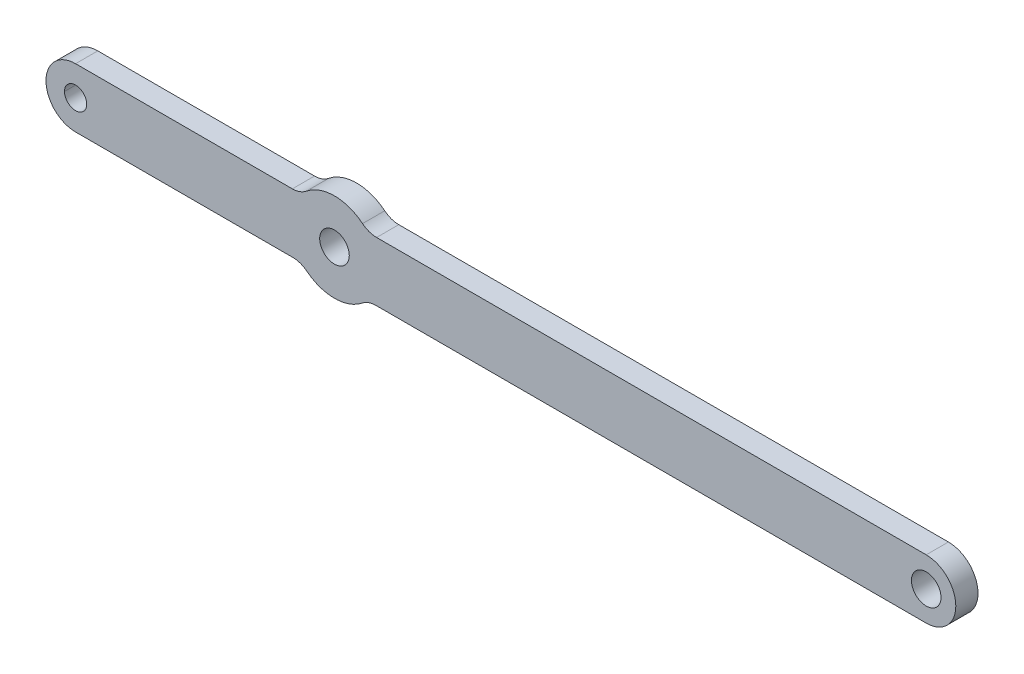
ISO-10303-21;
HEADER;
FILE_DESCRIPTION(('STEP AP214'),'2;1');
FILE_NAME('part.step','',(''),(''),'','','');
FILE_SCHEMA(('AUTOMOTIVE_DESIGN { 1 0 10303 214 1 1 1 1 }'));
ENDSEC;
DATA;
#1=APPLICATION_CONTEXT('core data for automotive mechanical design processes');
#2=APPLICATION_PROTOCOL_DEFINITION('international standard','automotive_design',2000,#1);
#3=PRODUCT_CONTEXT('',#1,'mechanical');
#4=PRODUCT('Part','Part','',(#3));
#5=PRODUCT_RELATED_PRODUCT_CATEGORY('part','',(#4));
#6=PRODUCT_DEFINITION_FORMATION('','',#4);
#7=PRODUCT_DEFINITION_CONTEXT('part definition',#1,'design');
#8=PRODUCT_DEFINITION('design','',#6,#7);
#9=PRODUCT_DEFINITION_SHAPE('','',#8);
#10=(LENGTH_UNIT() NAMED_UNIT(*) SI_UNIT(.MILLI.,.METRE.));
#11=(NAMED_UNIT(*) PLANE_ANGLE_UNIT() SI_UNIT($,.RADIAN.));
#12=(NAMED_UNIT(*) SI_UNIT($,.STERADIAN.) SOLID_ANGLE_UNIT());
#13=UNCERTAINTY_MEASURE_WITH_UNIT(LENGTH_MEASURE(1.E-05),#10,'distance_accuracy_value','');
#14=(GEOMETRIC_REPRESENTATION_CONTEXT(3) GLOBAL_UNCERTAINTY_ASSIGNED_CONTEXT((#13)) GLOBAL_UNIT_ASSIGNED_CONTEXT((#10,
#11,#12)) REPRESENTATION_CONTEXT('',''));
#15=CARTESIAN_POINT('',(0.,0.,0.));
#16=DIRECTION('',(0.,0.,1.));
#17=DIRECTION('',(1.,0.,0.));
#18=AXIS2_PLACEMENT_3D('',#15,#16,#17);
#19=CARTESIAN_POINT('',(101.910180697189,73.7175253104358,0.));
#20=DIRECTION('',(0.,0.,1.));
#21=DIRECTION('',(1.,0.,0.));
#22=AXIS2_PLACEMENT_3D('',#19,#20,#21);
#23=PLANE('',#22);
#24=CARTESIAN_POINT('',(216.910180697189,73.7175253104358,0.));
#25=DIRECTION('',(0.,0.,1.));
#26=DIRECTION('',(1.,0.,0.));
#27=AXIS2_PLACEMENT_3D('',#24,#25,#26);
#28=CIRCLE('',#27,2.);
#29=CARTESIAN_POINT('',(218.910180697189,73.7175253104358,0.));
#30=VERTEX_POINT('',#29);
#31=EDGE_CURVE('E343',#30,#30,#28,.T.);
#32=ORIENTED_EDGE('',*,*,#31,.T.);
#33=EDGE_LOOP('',(#32));
#34=FACE_BOUND('',#33,.T.);
#35=CARTESIAN_POINT('',(136.910180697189,73.7471789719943,0.));
#36=DIRECTION('',(0.,0.,1.));
#37=DIRECTION('',(1.,0.,0.));
#38=AXIS2_PLACEMENT_3D('',#35,#36,#37);
#39=CIRCLE('',#38,2.);
#40=CARTESIAN_POINT('',(138.910180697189,73.7471789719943,0.));
#41=VERTEX_POINT('',#40);
#42=EDGE_CURVE('E145',#41,#41,#39,.T.);
#43=ORIENTED_EDGE('',*,*,#42,.T.);
#44=EDGE_LOOP('',(#43));
#45=FACE_BOUND('',#44,.T.);
#46=CARTESIAN_POINT('',(101.910180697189,73.7175253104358,0.));
#47=DIRECTION('',(0.,0.,-1.));
#48=DIRECTION('',(-1.,0.,0.));
#49=AXIS2_PLACEMENT_3D('',#46,#47,#48);
#50=CIRCLE('',#49,1.5);
#51=CARTESIAN_POINT('',(103.410180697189,73.7175253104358,0.));
#52=VERTEX_POINT('',#51);
#53=CARTESIAN_POINT('',(100.410180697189,73.7175253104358,0.));
#54=VERTEX_POINT('',#53);
#55=EDGE_CURVE('E159',#52,#54,#50,.F.);
#56=ORIENTED_EDGE('',*,*,#55,.T.);
#57=CARTESIAN_POINT('',(101.910180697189,73.7175253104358,0.));
#58=DIRECTION('',(0.,0.,-1.));
#59=DIRECTION('',(-1.,0.,0.));
#60=AXIS2_PLACEMENT_3D('',#57,#58,#59);
#61=CIRCLE('',#60,1.5);
#62=EDGE_CURVE('E157',#54,#52,#61,.F.);
#63=ORIENTED_EDGE('',*,*,#62,.T.);
#64=EDGE_LOOP('',(#56,#63));
#65=FACE_BOUND('',#64,.T.);
#66=DIRECTION('',(1.,0.,0.));
#67=VECTOR('',#66,1.);
#68=CARTESIAN_POINT('',(101.910180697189,77.7175253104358,0.));
#69=LINE('',#68,#67);
#70=CARTESIAN_POINT('',(101.910180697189,77.7175253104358,0.));
#71=VERTEX_POINT('',#70);
#72=CARTESIAN_POINT('',(131.216827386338,77.7175253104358,0.));
#73=VERTEX_POINT('',#72);
#74=EDGE_CURVE('E138',#71,#73,#69,.T.);
#75=ORIENTED_EDGE('',*,*,#74,.T.);
#76=CARTESIAN_POINT('',(131.216827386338,80.7175253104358,0.));
#77=DIRECTION('',(0.,0.,-1.));
#78=DIRECTION('',(-1.,0.,0.));
#79=AXIS2_PLACEMENT_3D('',#76,#77,#78);
#80=CIRCLE('',#79,3.);
#81=CARTESIAN_POINT('',(133.114611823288,78.3940765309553,0.));
#82=VERTEX_POINT('',#81);
#83=EDGE_CURVE('E211',#73,#82,#80,.F.);
#84=ORIENTED_EDGE('',*,*,#83,.T.);
#85=CARTESIAN_POINT('',(136.910180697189,73.7471789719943,0.));
#86=DIRECTION('',(0.,0.,-1.));
#87=DIRECTION('',(-1.,0.,0.));
#88=AXIS2_PLACEMENT_3D('',#85,#86,#87);
#89=CIRCLE('',#88,6.00000000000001);
#90=CARTESIAN_POINT('',(140.705749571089,78.3940765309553,0.));
#91=VERTEX_POINT('',#90);
#92=EDGE_CURVE('E214',#91,#82,#89,.F.);
#93=ORIENTED_EDGE('',*,*,#92,.F.);
#94=CARTESIAN_POINT('',(142.60353400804,80.7175253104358,0.));
#95=DIRECTION('',(0.,0.,-1.));
#96=DIRECTION('',(-1.,0.,0.));
#97=AXIS2_PLACEMENT_3D('',#94,#95,#96);
#98=CIRCLE('',#97,3.);
#99=CARTESIAN_POINT('',(142.60353400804,77.7175253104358,0.));
#100=VERTEX_POINT('',#99);
#101=EDGE_CURVE('E217',#91,#100,#98,.F.);
#102=ORIENTED_EDGE('',*,*,#101,.T.);
#103=DIRECTION('',(1.,0.,0.));
#104=VECTOR('',#103,1.);
#105=CARTESIAN_POINT('',(142.60353400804,77.7175253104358,0.));
#106=LINE('',#105,#104);
#107=CARTESIAN_POINT('',(216.910180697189,77.7175253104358,0.));
#108=VERTEX_POINT('',#107);
#109=EDGE_CURVE('E164',#100,#108,#106,.T.);
#110=ORIENTED_EDGE('',*,*,#109,.T.);
#111=CARTESIAN_POINT('',(216.910180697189,73.7175253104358,0.));
#112=DIRECTION('',(0.,0.,-1.));
#113=DIRECTION('',(-1.,0.,0.));
#114=AXIS2_PLACEMENT_3D('',#111,#112,#113);
#115=CIRCLE('',#114,4.);
#116=CARTESIAN_POINT('',(216.910180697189,69.7175253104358,0.));
#117=VERTEX_POINT('',#116);
#118=EDGE_CURVE('E172',#117,#108,#115,.F.);
#119=ORIENTED_EDGE('',*,*,#118,.F.);
#120=DIRECTION('',(1.,0.,0.));
#121=VECTOR('',#120,1.);
#122=CARTESIAN_POINT('',(142.530142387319,69.7175253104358,0.));
#123=LINE('',#122,#121);
#124=CARTESIAN_POINT('',(142.530142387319,69.7175253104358,0.));
#125=VERTEX_POINT('',#124);
#126=EDGE_CURVE('E169',#117,#125,#123,.F.);
#127=ORIENTED_EDGE('',*,*,#126,.T.);
#128=CARTESIAN_POINT('',(142.530142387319,66.7175253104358,0.));
#129=DIRECTION('',(0.,0.,-1.));
#130=DIRECTION('',(-1.,0.,0.));
#131=AXIS2_PLACEMENT_3D('',#128,#129,#130);
#132=CIRCLE('',#131,3.);
#133=CARTESIAN_POINT('',(140.656821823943,69.060743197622,0.));
#134=VERTEX_POINT('',#133);
#135=EDGE_CURVE('E222',#125,#134,#132,.F.);
#136=ORIENTED_EDGE('',*,*,#135,.T.);
#137=CARTESIAN_POINT('',(136.910180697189,73.7471789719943,0.));
#138=DIRECTION('',(0.,0.,-1.));
#139=DIRECTION('',(-1.,0.,0.));
#140=AXIS2_PLACEMENT_3D('',#137,#138,#139);
#141=CIRCLE('',#140,6.00000000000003);
#142=CARTESIAN_POINT('',(133.163539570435,69.060743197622,0.));
#143=VERTEX_POINT('',#142);
#144=EDGE_CURVE('E226',#143,#134,#141,.F.);
#145=ORIENTED_EDGE('',*,*,#144,.F.);
#146=CARTESIAN_POINT('',(131.290219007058,66.7175253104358,0.));
#147=DIRECTION('',(0.,0.,-1.));
#148=DIRECTION('',(-1.,0.,0.));
#149=AXIS2_PLACEMENT_3D('',#146,#147,#148);
#150=CIRCLE('',#149,3.);
#151=CARTESIAN_POINT('',(131.290219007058,69.7175253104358,0.));
#152=VERTEX_POINT('',#151);
#153=EDGE_CURVE('E229',#143,#152,#150,.F.);
#154=ORIENTED_EDGE('',*,*,#153,.T.);
#155=DIRECTION('',(1.,0.,0.));
#156=VECTOR('',#155,1.);
#157=CARTESIAN_POINT('',(101.910180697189,69.7175253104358,0.));
#158=LINE('',#157,#156);
#159=CARTESIAN_POINT('',(101.910180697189,69.7175253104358,0.));
#160=VERTEX_POINT('',#159);
#161=EDGE_CURVE('E174',#152,#160,#158,.F.);
#162=ORIENTED_EDGE('',*,*,#161,.T.);
#163=CARTESIAN_POINT('',(101.910180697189,73.7175253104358,0.));
#164=DIRECTION('',(0.,0.,-1.));
#165=DIRECTION('',(-1.,0.,0.));
#166=AXIS2_PLACEMENT_3D('',#163,#164,#165);
#167=CIRCLE('',#166,4.);
#168=CARTESIAN_POINT('',(97.9101806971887,73.7175253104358,0.));
#169=VERTEX_POINT('',#168);
#170=EDGE_CURVE('E141',#169,#160,#167,.F.);
#171=ORIENTED_EDGE('',*,*,#170,.F.);
#172=CARTESIAN_POINT('',(101.910180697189,73.7175253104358,0.));
#173=DIRECTION('',(0.,0.,-1.));
#174=DIRECTION('',(-1.,0.,0.));
#175=AXIS2_PLACEMENT_3D('',#172,#173,#174);
#176=CIRCLE('',#175,4.);
#177=EDGE_CURVE('E33',#71,#169,#176,.F.);
#178=ORIENTED_EDGE('',*,*,#177,.F.);
#179=EDGE_LOOP('',(#75,#84,#93,#102,#110,#119,#127,#136,#145,#154,#162,#171,#178));
#180=FACE_BOUND('',#179,.T.);
#181=ADVANCED_FACE('F30',(#34,#45,#65,#180),#23,.F.);
#182=CARTESIAN_POINT('',(101.910180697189,73.7175253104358,3.));
#183=DIRECTION('',(0.,0.,-1.));
#184=DIRECTION('',(-1.,0.,0.));
#185=AXIS2_PLACEMENT_3D('',#182,#183,#184);
#186=CYLINDRICAL_SURFACE('',#185,4.);
#187=DIRECTION('',(0.,0.,-1.));
#188=VECTOR('',#187,1.);
#189=CARTESIAN_POINT('',(101.910180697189,77.7175253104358,3.));
#190=LINE('',#189,#188);
#191=CARTESIAN_POINT('',(101.910180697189,77.7175253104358,3.));
#192=VERTEX_POINT('',#191);
#193=EDGE_CURVE('E147',#192,#71,#190,.T.);
#194=ORIENTED_EDGE('',*,*,#193,.T.);
#195=ORIENTED_EDGE('',*,*,#177,.T.);
#196=DIRECTION('',(0.,0.,-1.));
#197=VECTOR('',#196,1.);
#198=CARTESIAN_POINT('',(97.9101806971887,73.7175253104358,3.));
#199=LINE('',#198,#197);
#200=CARTESIAN_POINT('',(97.9101806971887,73.7175253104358,3.));
#201=VERTEX_POINT('',#200);
#202=EDGE_CURVE('E144',#201,#169,#199,.T.);
#203=ORIENTED_EDGE('',*,*,#202,.F.);
#204=CARTESIAN_POINT('',(101.910180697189,73.7175253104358,3.));
#205=DIRECTION('',(0.,0.,-1.));
#206=DIRECTION('',(-1.,0.,0.));
#207=AXIS2_PLACEMENT_3D('',#204,#205,#206);
#208=CIRCLE('',#207,4.);
#209=EDGE_CURVE('E150',#192,#201,#208,.F.);
#210=ORIENTED_EDGE('',*,*,#209,.F.);
#211=EDGE_LOOP('',(#194,#195,#203,#210));
#212=FACE_BOUND('',#211,.T.);
#213=ADVANCED_FACE('F148',(#212),#186,.T.);
#214=CARTESIAN_POINT('',(101.910180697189,73.7175253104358,3.));
#215=DIRECTION('',(0.,0.,-1.));
#216=DIRECTION('',(-1.,0.,0.));
#217=AXIS2_PLACEMENT_3D('',#214,#215,#216);
#218=CYLINDRICAL_SURFACE('',#217,4.);
#219=ORIENTED_EDGE('',*,*,#170,.T.);
#220=DIRECTION('',(0.,0.,1.));
#221=VECTOR('',#220,1.);
#222=CARTESIAN_POINT('',(101.910180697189,69.7175253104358,3.));
#223=LINE('',#222,#221);
#224=CARTESIAN_POINT('',(101.910180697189,69.7175253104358,3.));
#225=VERTEX_POINT('',#224);
#226=EDGE_CURVE('E176',#160,#225,#223,.T.);
#227=ORIENTED_EDGE('',*,*,#226,.T.);
#228=CARTESIAN_POINT('',(101.910180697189,73.7175253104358,3.));
#229=DIRECTION('',(0.,0.,-1.));
#230=DIRECTION('',(-1.,0.,0.));
#231=AXIS2_PLACEMENT_3D('',#228,#229,#230);
#232=CIRCLE('',#231,4.);
#233=EDGE_CURVE('E205',#201,#225,#232,.F.);
#234=ORIENTED_EDGE('',*,*,#233,.F.);
#235=ORIENTED_EDGE('',*,*,#202,.T.);
#236=EDGE_LOOP('',(#219,#227,#234,#235));
#237=FACE_BOUND('',#236,.T.);
#238=ADVANCED_FACE('F233',(#237),#218,.T.);
#239=CARTESIAN_POINT('',(101.910180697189,69.7175253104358,3.));
#240=DIRECTION('',(0.,1.,0.));
#241=DIRECTION('',(0.,0.,1.));
#242=AXIS2_PLACEMENT_3D('',#239,#240,#241);
#243=PLANE('',#242);
#244=DIRECTION('',(0.,0.,-1.));
#245=VECTOR('',#244,1.);
#246=CARTESIAN_POINT('',(131.290219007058,69.7175253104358,3.));
#247=LINE('',#246,#245);
#248=CARTESIAN_POINT('',(131.290219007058,69.7175253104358,3.));
#249=VERTEX_POINT('',#248);
#250=EDGE_CURVE('E175',#152,#249,#247,.F.);
#251=ORIENTED_EDGE('',*,*,#250,.T.);
#252=DIRECTION('',(1.,0.,0.));
#253=VECTOR('',#252,1.);
#254=CARTESIAN_POINT('',(101.910180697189,69.7175253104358,3.));
#255=LINE('',#254,#253);
#256=EDGE_CURVE('E204',#225,#249,#255,.T.);
#257=ORIENTED_EDGE('',*,*,#256,.F.);
#258=ORIENTED_EDGE('',*,*,#226,.F.);
#259=ORIENTED_EDGE('',*,*,#161,.F.);
#260=EDGE_LOOP('',(#251,#257,#258,#259));
#261=FACE_BOUND('',#260,.T.);
#262=ADVANCED_FACE('F268',(#261),#243,.F.);
#263=CARTESIAN_POINT('',(131.290219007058,66.7175253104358,3.));
#264=DIRECTION('',(0.,0.,-1.));
#265=DIRECTION('',(-1.,0.,0.));
#266=AXIS2_PLACEMENT_3D('',#263,#264,#265);
#267=CYLINDRICAL_SURFACE('',#266,3.);
#268=DIRECTION('',(0.,0.,-1.));
#269=VECTOR('',#268,1.);
#270=CARTESIAN_POINT('',(133.163539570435,69.060743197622,3.));
#271=LINE('',#270,#269);
#272=CARTESIAN_POINT('',(133.163539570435,69.060743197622,3.));
#273=VERTEX_POINT('',#272);
#274=EDGE_CURVE('E228',#273,#143,#271,.T.);
#275=ORIENTED_EDGE('',*,*,#274,.F.);
#276=CARTESIAN_POINT('',(131.290219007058,66.7175253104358,3.));
#277=DIRECTION('',(0.,0.,-1.));
#278=DIRECTION('',(-1.,0.,0.));
#279=AXIS2_PLACEMENT_3D('',#276,#277,#278);
#280=CIRCLE('',#279,3.);
#281=EDGE_CURVE('E201',#249,#273,#280,.T.);
#282=ORIENTED_EDGE('',*,*,#281,.F.);
#283=ORIENTED_EDGE('',*,*,#250,.F.);
#284=ORIENTED_EDGE('',*,*,#153,.F.);
#285=EDGE_LOOP('',(#275,#282,#283,#284));
#286=FACE_BOUND('',#285,.T.);
#287=ADVANCED_FACE('F271',(#286),#267,.F.);
#288=CARTESIAN_POINT('',(136.910180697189,73.7471789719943,3.));
#289=DIRECTION('',(0.,0.,-1.));
#290=DIRECTION('',(-1.,0.,0.));
#291=AXIS2_PLACEMENT_3D('',#288,#289,#290);
#292=CYLINDRICAL_SURFACE('',#291,6.00000000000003);
#293=CARTESIAN_POINT('',(136.910180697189,73.7471789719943,3.));
#294=DIRECTION('',(0.,0.,-1.));
#295=DIRECTION('',(-1.,0.,0.));
#296=AXIS2_PLACEMENT_3D('',#293,#294,#295);
#297=CIRCLE('',#296,6.00000000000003);
#298=CARTESIAN_POINT('',(140.656821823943,69.060743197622,3.));
#299=VERTEX_POINT('',#298);
#300=EDGE_CURVE('E198',#273,#299,#297,.F.);
#301=ORIENTED_EDGE('',*,*,#300,.F.);
#302=ORIENTED_EDGE('',*,*,#274,.T.);
#303=ORIENTED_EDGE('',*,*,#144,.T.);
#304=DIRECTION('',(0.,0.,-1.));
#305=VECTOR('',#304,1.);
#306=CARTESIAN_POINT('',(140.656821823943,69.060743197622,3.));
#307=LINE('',#306,#305);
#308=EDGE_CURVE('E225',#134,#299,#307,.F.);
#309=ORIENTED_EDGE('',*,*,#308,.T.);
#310=EDGE_LOOP('',(#301,#302,#303,#309));
#311=FACE_BOUND('',#310,.T.);
#312=ADVANCED_FACE('F275',(#311),#292,.T.);
#313=CARTESIAN_POINT('',(142.530142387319,66.7175253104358,3.));
#314=DIRECTION('',(0.,0.,-1.));
#315=DIRECTION('',(-1.,0.,0.));
#316=AXIS2_PLACEMENT_3D('',#313,#314,#315);
#317=CYLINDRICAL_SURFACE('',#316,3.);
#318=DIRECTION('',(0.,0.,1.));
#319=VECTOR('',#318,1.);
#320=CARTESIAN_POINT('',(142.530142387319,69.7175253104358,3.));
#321=LINE('',#320,#319);
#322=CARTESIAN_POINT('',(142.530142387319,69.7175253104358,3.));
#323=VERTEX_POINT('',#322);
#324=EDGE_CURVE('E173',#125,#323,#321,.T.);
#325=ORIENTED_EDGE('',*,*,#324,.T.);
#326=CARTESIAN_POINT('',(142.530142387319,66.7175253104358,3.));
#327=DIRECTION('',(0.,0.,-1.));
#328=DIRECTION('',(-1.,0.,0.));
#329=AXIS2_PLACEMENT_3D('',#326,#327,#328);
#330=CIRCLE('',#329,3.);
#331=EDGE_CURVE('E195',#299,#323,#330,.T.);
#332=ORIENTED_EDGE('',*,*,#331,.F.);
#333=ORIENTED_EDGE('',*,*,#308,.F.);
#334=ORIENTED_EDGE('',*,*,#135,.F.);
#335=EDGE_LOOP('',(#325,#332,#333,#334));
#336=FACE_BOUND('',#335,.T.);
#337=ADVANCED_FACE('F278',(#336),#317,.F.);
#338=CARTESIAN_POINT('',(142.530142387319,69.7175253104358,3.));
#339=DIRECTION('',(0.,1.,0.));
#340=DIRECTION('',(0.,0.,1.));
#341=AXIS2_PLACEMENT_3D('',#338,#339,#340);
#342=PLANE('',#341);
#343=DIRECTION('',(0.,0.,-1.));
#344=VECTOR('',#343,1.);
#345=CARTESIAN_POINT('',(216.910180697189,69.7175253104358,3.));
#346=LINE('',#345,#344);
#347=CARTESIAN_POINT('',(216.910180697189,69.7175253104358,3.));
#348=VERTEX_POINT('',#347);
#349=EDGE_CURVE('E221',#348,#117,#346,.T.);
#350=ORIENTED_EDGE('',*,*,#349,.F.);
#351=DIRECTION('',(1.,0.,0.));
#352=VECTOR('',#351,1.);
#353=CARTESIAN_POINT('',(101.910180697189,69.7175253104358,3.));
#354=LINE('',#353,#352);
#355=EDGE_CURVE('E194',#323,#348,#354,.T.);
#356=ORIENTED_EDGE('',*,*,#355,.F.);
#357=ORIENTED_EDGE('',*,*,#324,.F.);
#358=ORIENTED_EDGE('',*,*,#126,.F.);
#359=EDGE_LOOP('',(#350,#356,#357,#358));
#360=FACE_BOUND('',#359,.T.);
#361=ADVANCED_FACE('F283',(#360),#342,.F.);
#362=CARTESIAN_POINT('',(216.910180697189,73.7175253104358,3.));
#363=DIRECTION('',(0.,0.,-1.));
#364=DIRECTION('',(-1.,0.,0.));
#365=AXIS2_PLACEMENT_3D('',#362,#363,#364);
#366=CYLINDRICAL_SURFACE('',#365,4.);
#367=CARTESIAN_POINT('',(216.910180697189,73.7175253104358,3.));
#368=DIRECTION('',(0.,0.,-1.));
#369=DIRECTION('',(-1.,0.,0.));
#370=AXIS2_PLACEMENT_3D('',#367,#368,#369);
#371=CIRCLE('',#370,4.);
#372=CARTESIAN_POINT('',(216.910180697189,77.7175253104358,3.));
#373=VERTEX_POINT('',#372);
#374=EDGE_CURVE('E191',#348,#373,#371,.F.);
#375=ORIENTED_EDGE('',*,*,#374,.F.);
#376=ORIENTED_EDGE('',*,*,#349,.T.);
#377=ORIENTED_EDGE('',*,*,#118,.T.);
#378=DIRECTION('',(0.,0.,-1.));
#379=VECTOR('',#378,1.);
#380=CARTESIAN_POINT('',(216.910180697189,77.7175253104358,3.));
#381=LINE('',#380,#379);
#382=EDGE_CURVE('E168',#108,#373,#381,.F.);
#383=ORIENTED_EDGE('',*,*,#382,.T.);
#384=EDGE_LOOP('',(#375,#376,#377,#383));
#385=FACE_BOUND('',#384,.T.);
#386=ADVANCED_FACE('F287',(#385),#366,.T.);
#387=CARTESIAN_POINT('',(142.60353400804,77.7175253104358,3.));
#388=DIRECTION('',(0.,-1.,0.));
#389=DIRECTION('',(0.,0.,-1.));
#390=AXIS2_PLACEMENT_3D('',#387,#388,#389);
#391=PLANE('',#390);
#392=DIRECTION('',(0.,0.,-1.));
#393=VECTOR('',#392,1.);
#394=CARTESIAN_POINT('',(142.60353400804,77.7175253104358,3.));
#395=LINE('',#394,#393);
#396=CARTESIAN_POINT('',(142.60353400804,77.7175253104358,3.));
#397=VERTEX_POINT('',#396);
#398=EDGE_CURVE('E167',#100,#397,#395,.F.);
#399=ORIENTED_EDGE('',*,*,#398,.T.);
#400=DIRECTION('',(1.,0.,0.));
#401=VECTOR('',#400,1.);
#402=CARTESIAN_POINT('',(101.910180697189,77.7175253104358,3.));
#403=LINE('',#402,#401);
#404=EDGE_CURVE('E190',#373,#397,#403,.F.);
#405=ORIENTED_EDGE('',*,*,#404,.F.);
#406=ORIENTED_EDGE('',*,*,#382,.F.);
#407=ORIENTED_EDGE('',*,*,#109,.F.);
#408=EDGE_LOOP('',(#399,#405,#406,#407));
#409=FACE_BOUND('',#408,.T.);
#410=ADVANCED_FACE('F290',(#409),#391,.F.);
#411=CARTESIAN_POINT('',(142.60353400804,80.7175253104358,3.));
#412=DIRECTION('',(0.,0.,-1.));
#413=DIRECTION('',(-1.,0.,0.));
#414=AXIS2_PLACEMENT_3D('',#411,#412,#413);
#415=CYLINDRICAL_SURFACE('',#414,3.);
#416=DIRECTION('',(0.,0.,-1.));
#417=VECTOR('',#416,1.);
#418=CARTESIAN_POINT('',(140.705749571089,78.3940765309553,3.));
#419=LINE('',#418,#417);
#420=CARTESIAN_POINT('',(140.705749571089,78.3940765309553,3.));
#421=VERTEX_POINT('',#420);
#422=EDGE_CURVE('E216',#421,#91,#419,.T.);
#423=ORIENTED_EDGE('',*,*,#422,.F.);
#424=CARTESIAN_POINT('',(142.60353400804,80.7175253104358,3.));
#425=DIRECTION('',(0.,0.,-1.));
#426=DIRECTION('',(-1.,0.,0.));
#427=AXIS2_PLACEMENT_3D('',#424,#425,#426);
#428=CIRCLE('',#427,3.);
#429=EDGE_CURVE('E187',#397,#421,#428,.T.);
#430=ORIENTED_EDGE('',*,*,#429,.F.);
#431=ORIENTED_EDGE('',*,*,#398,.F.);
#432=ORIENTED_EDGE('',*,*,#101,.F.);
#433=EDGE_LOOP('',(#423,#430,#431,#432));
#434=FACE_BOUND('',#433,.T.);
#435=ADVANCED_FACE('F295',(#434),#415,.F.);
#436=CARTESIAN_POINT('',(136.910180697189,73.7471789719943,3.));
#437=DIRECTION('',(0.,0.,-1.));
#438=DIRECTION('',(-1.,0.,0.));
#439=AXIS2_PLACEMENT_3D('',#436,#437,#438);
#440=CYLINDRICAL_SURFACE('',#439,6.00000000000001);
#441=CARTESIAN_POINT('',(136.910180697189,73.7471789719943,3.));
#442=DIRECTION('',(0.,0.,-1.));
#443=DIRECTION('',(-1.,0.,0.));
#444=AXIS2_PLACEMENT_3D('',#441,#442,#443);
#445=CIRCLE('',#444,6.00000000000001);
#446=CARTESIAN_POINT('',(133.114611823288,78.3940765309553,3.));
#447=VERTEX_POINT('',#446);
#448=EDGE_CURVE('E184',#421,#447,#445,.F.);
#449=ORIENTED_EDGE('',*,*,#448,.F.);
#450=ORIENTED_EDGE('',*,*,#422,.T.);
#451=ORIENTED_EDGE('',*,*,#92,.T.);
#452=DIRECTION('',(0.,0.,-1.));
#453=VECTOR('',#452,1.);
#454=CARTESIAN_POINT('',(133.114611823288,78.3940765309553,3.));
#455=LINE('',#454,#453);
#456=EDGE_CURVE('E213',#82,#447,#455,.F.);
#457=ORIENTED_EDGE('',*,*,#456,.T.);
#458=EDGE_LOOP('',(#449,#450,#451,#457));
#459=FACE_BOUND('',#458,.T.);
#460=ADVANCED_FACE('F298',(#459),#440,.T.);
#461=CARTESIAN_POINT('',(131.216827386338,80.7175253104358,3.));
#462=DIRECTION('',(0.,0.,-1.));
#463=DIRECTION('',(-1.,0.,0.));
#464=AXIS2_PLACEMENT_3D('',#461,#462,#463);
#465=CYLINDRICAL_SURFACE('',#464,3.);
#466=DIRECTION('',(0.,0.,-1.));
#467=VECTOR('',#466,1.);
#468=CARTESIAN_POINT('',(131.216827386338,77.7175253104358,3.));
#469=LINE('',#468,#467);
#470=CARTESIAN_POINT('',(131.216827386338,77.7175253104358,3.));
#471=VERTEX_POINT('',#470);
#472=EDGE_CURVE('E154',#73,#471,#469,.F.);
#473=ORIENTED_EDGE('',*,*,#472,.T.);
#474=CARTESIAN_POINT('',(131.216827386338,80.7175253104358,3.));
#475=DIRECTION('',(0.,0.,-1.));
#476=DIRECTION('',(-1.,0.,0.));
#477=AXIS2_PLACEMENT_3D('',#474,#475,#476);
#478=CIRCLE('',#477,3.);
#479=EDGE_CURVE('E181',#447,#471,#478,.T.);
#480=ORIENTED_EDGE('',*,*,#479,.F.);
#481=ORIENTED_EDGE('',*,*,#456,.F.);
#482=ORIENTED_EDGE('',*,*,#83,.F.);
#483=EDGE_LOOP('',(#473,#480,#481,#482));
#484=FACE_BOUND('',#483,.T.);
#485=ADVANCED_FACE('F301',(#484),#465,.F.);
#486=CARTESIAN_POINT('',(101.910180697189,77.7175253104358,3.));
#487=DIRECTION('',(0.,-1.,0.));
#488=DIRECTION('',(0.,0.,-1.));
#489=AXIS2_PLACEMENT_3D('',#486,#487,#488);
#490=PLANE('',#489);
#491=ORIENTED_EDGE('',*,*,#193,.F.);
#492=DIRECTION('',(1.,0.,0.));
#493=VECTOR('',#492,1.);
#494=CARTESIAN_POINT('',(101.910180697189,77.7175253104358,3.));
#495=LINE('',#494,#493);
#496=EDGE_CURVE('E180',#471,#192,#495,.F.);
#497=ORIENTED_EDGE('',*,*,#496,.F.);
#498=ORIENTED_EDGE('',*,*,#472,.F.);
#499=ORIENTED_EDGE('',*,*,#74,.F.);
#500=EDGE_LOOP('',(#491,#497,#498,#499));
#501=FACE_BOUND('',#500,.T.);
#502=ADVANCED_FACE('F156',(#501),#490,.F.);
#503=CARTESIAN_POINT('',(101.910180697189,73.7175253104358,3.));
#504=DIRECTION('',(0.,0.,-1.));
#505=DIRECTION('',(-1.,0.,0.));
#506=AXIS2_PLACEMENT_3D('',#503,#504,#505);
#507=CYLINDRICAL_SURFACE('',#506,1.5);
#508=DIRECTION('',(0.,0.,-1.));
#509=VECTOR('',#508,1.);
#510=CARTESIAN_POINT('',(103.410180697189,73.7175253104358,3.));
#511=LINE('',#510,#509);
#512=CARTESIAN_POINT('',(103.410180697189,73.7175253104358,3.));
#513=VERTEX_POINT('',#512);
#514=EDGE_CURVE('E209',#513,#52,#511,.T.);
#515=ORIENTED_EDGE('',*,*,#514,.T.);
#516=ORIENTED_EDGE('',*,*,#62,.F.);
#517=DIRECTION('',(0.,0.,-1.));
#518=VECTOR('',#517,1.);
#519=CARTESIAN_POINT('',(100.410180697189,73.7175253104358,3.));
#520=LINE('',#519,#518);
#521=CARTESIAN_POINT('',(100.410180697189,73.7175253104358,3.));
#522=VERTEX_POINT('',#521);
#523=EDGE_CURVE('E48',#54,#522,#520,.F.);
#524=ORIENTED_EDGE('',*,*,#523,.T.);
#525=CARTESIAN_POINT('',(101.910180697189,73.7175253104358,3.));
#526=DIRECTION('',(0.,0.,-1.));
#527=DIRECTION('',(-1.,0.,0.));
#528=AXIS2_PLACEMENT_3D('',#525,#526,#527);
#529=CIRCLE('',#528,1.5);
#530=EDGE_CURVE('E39',#513,#522,#529,.T.);
#531=ORIENTED_EDGE('',*,*,#530,.F.);
#532=EDGE_LOOP('',(#515,#516,#524,#531));
#533=FACE_BOUND('',#532,.T.);
#534=ADVANCED_FACE('F308',(#533),#507,.F.);
#535=CARTESIAN_POINT('',(101.910180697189,73.7175253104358,3.));
#536=DIRECTION('',(0.,0.,-1.));
#537=DIRECTION('',(-1.,0.,0.));
#538=AXIS2_PLACEMENT_3D('',#535,#536,#537);
#539=CYLINDRICAL_SURFACE('',#538,1.5);
#540=CARTESIAN_POINT('',(101.910180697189,73.7175253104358,3.));
#541=DIRECTION('',(0.,0.,-1.));
#542=DIRECTION('',(-1.,0.,0.));
#543=AXIS2_PLACEMENT_3D('',#540,#541,#542);
#544=CIRCLE('',#543,1.5);
#545=EDGE_CURVE('E11',#522,#513,#544,.T.);
#546=ORIENTED_EDGE('',*,*,#545,.F.);
#547=ORIENTED_EDGE('',*,*,#523,.F.);
#548=ORIENTED_EDGE('',*,*,#55,.F.);
#549=ORIENTED_EDGE('',*,*,#514,.F.);
#550=EDGE_LOOP('',(#546,#547,#548,#549));
#551=FACE_BOUND('',#550,.T.);
#552=ADVANCED_FACE('F313',(#551),#539,.F.);
#553=CARTESIAN_POINT('',(101.910180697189,73.7175253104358,3.));
#554=DIRECTION('',(0.,0.,1.));
#555=DIRECTION('',(1.,0.,0.));
#556=AXIS2_PLACEMENT_3D('',#553,#554,#555);
#557=PLANE('',#556);
#558=CARTESIAN_POINT('',(216.910180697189,73.7175253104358,3.));
#559=DIRECTION('',(0.,0.,1.));
#560=DIRECTION('',(1.,0.,0.));
#561=AXIS2_PLACEMENT_3D('',#558,#559,#560);
#562=CIRCLE('',#561,2.);
#563=CARTESIAN_POINT('',(218.910180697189,73.7175253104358,3.));
#564=VERTEX_POINT('',#563);
#565=EDGE_CURVE('E348',#564,#564,#562,.T.);
#566=ORIENTED_EDGE('',*,*,#565,.F.);
#567=EDGE_LOOP('',(#566));
#568=FACE_BOUND('',#567,.T.);
#569=CARTESIAN_POINT('',(136.910180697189,73.7471789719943,3.));
#570=DIRECTION('',(0.,0.,1.));
#571=DIRECTION('',(1.,0.,0.));
#572=AXIS2_PLACEMENT_3D('',#569,#570,#571);
#573=CIRCLE('',#572,2.);
#574=CARTESIAN_POINT('',(138.910180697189,73.7471789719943,3.));
#575=VERTEX_POINT('',#574);
#576=EDGE_CURVE('E243',#575,#575,#573,.T.);
#577=ORIENTED_EDGE('',*,*,#576,.F.);
#578=EDGE_LOOP('',(#577));
#579=FACE_BOUND('',#578,.T.);
#580=ORIENTED_EDGE('',*,*,#530,.T.);
#581=ORIENTED_EDGE('',*,*,#545,.T.);
#582=EDGE_LOOP('',(#580,#581));
#583=FACE_BOUND('',#582,.T.);
#584=ORIENTED_EDGE('',*,*,#479,.T.);
#585=ORIENTED_EDGE('',*,*,#496,.T.);
#586=ORIENTED_EDGE('',*,*,#209,.T.);
#587=ORIENTED_EDGE('',*,*,#233,.T.);
#588=ORIENTED_EDGE('',*,*,#256,.T.);
#589=ORIENTED_EDGE('',*,*,#281,.T.);
#590=ORIENTED_EDGE('',*,*,#300,.T.);
#591=ORIENTED_EDGE('',*,*,#331,.T.);
#592=ORIENTED_EDGE('',*,*,#355,.T.);
#593=ORIENTED_EDGE('',*,*,#374,.T.);
#594=ORIENTED_EDGE('',*,*,#404,.T.);
#595=ORIENTED_EDGE('',*,*,#429,.T.);
#596=ORIENTED_EDGE('',*,*,#448,.T.);
#597=EDGE_LOOP('',(#584,#585,#586,#587,#588,#589,#590,#591,#592,#593,#594,#595,#596));
#598=FACE_BOUND('',#597,.T.);
#599=ADVANCED_FACE('F238',(#568,#579,#583,#598),#557,.T.);
#600=CARTESIAN_POINT('',(136.910180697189,73.7471789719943,0.));
#601=DIRECTION('',(0.,0.,1.));
#602=DIRECTION('',(1.,0.,0.));
#603=AXIS2_PLACEMENT_3D('',#600,#601,#602);
#604=CYLINDRICAL_SURFACE('',#603,2.);
#605=ORIENTED_EDGE('',*,*,#42,.F.);
#606=EDGE_LOOP('',(#605));
#607=FACE_BOUND('',#606,.T.);
#608=ORIENTED_EDGE('',*,*,#576,.T.);
#609=EDGE_LOOP('',(#608));
#610=FACE_BOUND('',#609,.T.);
#611=ADVANCED_FACE('F312',(#607,#610),#604,.F.);
#612=CARTESIAN_POINT('',(216.910180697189,73.7175253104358,0.));
#613=DIRECTION('',(0.,0.,1.));
#614=DIRECTION('',(1.,0.,0.));
#615=AXIS2_PLACEMENT_3D('',#612,#613,#614);
#616=CYLINDRICAL_SURFACE('',#615,2.);
#617=ORIENTED_EDGE('',*,*,#31,.F.);
#618=EDGE_LOOP('',(#617));
#619=FACE_BOUND('',#618,.T.);
#620=ORIENTED_EDGE('',*,*,#565,.T.);
#621=EDGE_LOOP('',(#620));
#622=FACE_BOUND('',#621,.T.);
#623=ADVANCED_FACE('F320',(#619,#622),#616,.F.);
#624=CLOSED_SHELL('',(#181,#213,#238,#262,#287,#312,#337,#361,#386,#410,#435,#460,#485,#502,
#534,#552,#599,#611,#623));
#625=MANIFOLD_SOLID_BREP('B2',#624);
#626=ADVANCED_BREP_SHAPE_REPRESENTATION('',(#18,#625),#14);
#627=SHAPE_DEFINITION_REPRESENTATION(#9,#626);
ENDSEC;
END-ISO-10303-21;
